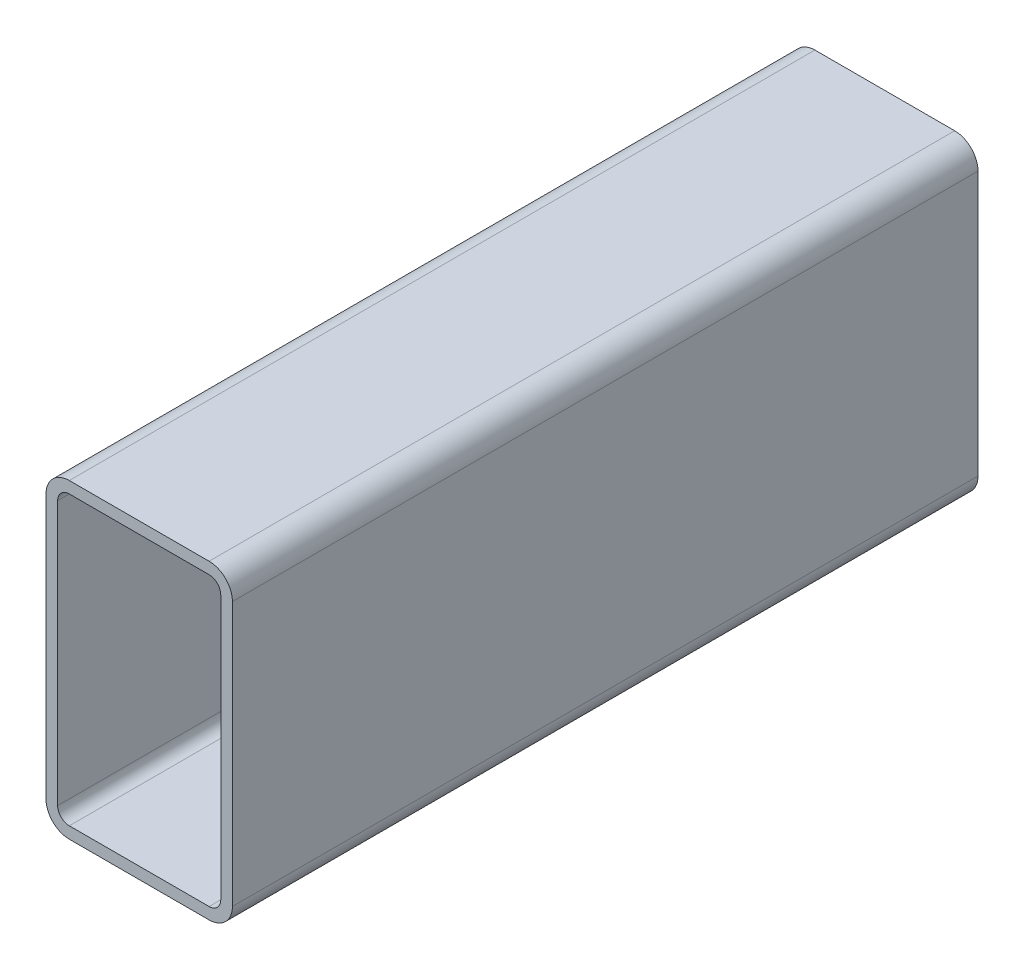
ISO-10303-21;
HEADER;
FILE_DESCRIPTION(('STEP AP214'),'2;1');
FILE_NAME('part.step','',(''),(''),'','','');
FILE_SCHEMA(('AUTOMOTIVE_DESIGN { 1 0 10303 214 1 1 1 1 }'));
ENDSEC;
DATA;
#1=APPLICATION_CONTEXT('core data for automotive mechanical design processes');
#2=APPLICATION_PROTOCOL_DEFINITION('international standard','automotive_design',2000,#1);
#3=PRODUCT_CONTEXT('',#1,'mechanical');
#4=PRODUCT('Part','Part','',(#3));
#5=PRODUCT_RELATED_PRODUCT_CATEGORY('part','',(#4));
#6=PRODUCT_DEFINITION_FORMATION('','',#4);
#7=PRODUCT_DEFINITION_CONTEXT('part definition',#1,'design');
#8=PRODUCT_DEFINITION('design','',#6,#7);
#9=PRODUCT_DEFINITION_SHAPE('','',#8);
#10=(LENGTH_UNIT() NAMED_UNIT(*) SI_UNIT(.MILLI.,.METRE.));
#11=(NAMED_UNIT(*) PLANE_ANGLE_UNIT() SI_UNIT($,.RADIAN.));
#12=(NAMED_UNIT(*) SI_UNIT($,.STERADIAN.) SOLID_ANGLE_UNIT());
#13=UNCERTAINTY_MEASURE_WITH_UNIT(LENGTH_MEASURE(1.E-05),#10,'distance_accuracy_value','');
#14=(GEOMETRIC_REPRESENTATION_CONTEXT(3) GLOBAL_UNCERTAINTY_ASSIGNED_CONTEXT((#13)) GLOBAL_UNIT_ASSIGNED_CONTEXT((#10,
#11,#12)) REPRESENTATION_CONTEXT('',''));
#15=CARTESIAN_POINT('',(0.,0.,0.));
#16=DIRECTION('',(0.,0.,1.));
#17=DIRECTION('',(1.,0.,0.));
#18=AXIS2_PLACEMENT_3D('',#15,#16,#17);
#19=CARTESIAN_POINT('',(12.0141160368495,119.509856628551,304.8));
#20=DIRECTION('',(0.,0.,1.));
#21=DIRECTION('',(1.,0.,0.));
#22=AXIS2_PLACEMENT_3D('',#19,#20,#21);
#23=PLANE('',#22);
#24=CARTESIAN_POINT('',(12.0141160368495,119.509856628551,304.8));
#25=DIRECTION('',(0.,0.,1.));
#26=DIRECTION('',(1.,0.,0.));
#27=AXIS2_PLACEMENT_3D('',#24,#25,#26);
#28=CIRCLE('',#27,9.52500000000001);
#29=CARTESIAN_POINT('',(12.0141160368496,129.034856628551,304.8));
#30=VERTEX_POINT('',#29);
#31=CARTESIAN_POINT('',(2.48911603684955,119.509856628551,304.8));
#32=VERTEX_POINT('',#31);
#33=EDGE_CURVE('E211',#30,#32,#28,.T.);
#34=ORIENTED_EDGE('',*,*,#33,.T.);
#35=DIRECTION('',(0.,-1.,0.));
#36=VECTOR('',#35,1.);
#37=CARTESIAN_POINT('',(2.48911603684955,11.5598566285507,304.8));
#38=LINE('',#37,#36);
#39=CARTESIAN_POINT('',(2.48911603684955,11.5598566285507,304.8));
#40=VERTEX_POINT('',#39);
#41=EDGE_CURVE('E214',#32,#40,#38,.T.);
#42=ORIENTED_EDGE('',*,*,#41,.T.);
#43=CARTESIAN_POINT('',(12.0141160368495,11.5598566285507,304.8));
#44=DIRECTION('',(0.,0.,1.));
#45=DIRECTION('',(1.,0.,0.));
#46=AXIS2_PLACEMENT_3D('',#43,#44,#45);
#47=CIRCLE('',#46,9.525);
#48=CARTESIAN_POINT('',(12.0141160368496,2.03485662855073,304.8));
#49=VERTEX_POINT('',#48);
#50=EDGE_CURVE('E217',#40,#49,#47,.T.);
#51=ORIENTED_EDGE('',*,*,#50,.T.);
#52=DIRECTION('',(1.,0.,0.));
#53=VECTOR('',#52,1.);
#54=CARTESIAN_POINT('',(69.1641160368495,2.03485662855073,304.8));
#55=LINE('',#54,#53);
#56=CARTESIAN_POINT('',(69.1641160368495,2.03485662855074,304.8));
#57=VERTEX_POINT('',#56);
#58=EDGE_CURVE('E219',#49,#57,#55,.T.);
#59=ORIENTED_EDGE('',*,*,#58,.T.);
#60=CARTESIAN_POINT('',(69.1641160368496,11.5598566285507,304.8));
#61=DIRECTION('',(0.,0.,1.));
#62=DIRECTION('',(1.,0.,0.));
#63=AXIS2_PLACEMENT_3D('',#60,#61,#62);
#64=CIRCLE('',#63,9.52499999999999);
#65=CARTESIAN_POINT('',(78.6891160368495,11.5598566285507,304.8));
#66=VERTEX_POINT('',#65);
#67=EDGE_CURVE('E221',#57,#66,#64,.T.);
#68=ORIENTED_EDGE('',*,*,#67,.T.);
#69=DIRECTION('',(0.,1.,0.));
#70=VECTOR('',#69,1.);
#71=CARTESIAN_POINT('',(78.6891160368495,119.509856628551,304.8));
#72=LINE('',#71,#70);
#73=CARTESIAN_POINT('',(78.6891160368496,119.509856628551,304.8));
#74=VERTEX_POINT('',#73);
#75=EDGE_CURVE('E223',#66,#74,#72,.T.);
#76=ORIENTED_EDGE('',*,*,#75,.T.);
#77=CARTESIAN_POINT('',(69.1641160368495,119.509856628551,304.8));
#78=DIRECTION('',(0.,0.,1.));
#79=DIRECTION('',(1.,0.,0.));
#80=AXIS2_PLACEMENT_3D('',#77,#78,#79);
#81=CIRCLE('',#80,9.52500000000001);
#82=CARTESIAN_POINT('',(69.1641160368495,129.034856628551,304.8));
#83=VERTEX_POINT('',#82);
#84=EDGE_CURVE('E225',#74,#83,#81,.T.);
#85=ORIENTED_EDGE('',*,*,#84,.T.);
#86=DIRECTION('',(-1.,0.,0.));
#87=VECTOR('',#86,1.);
#88=CARTESIAN_POINT('',(12.0141160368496,129.034856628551,304.8));
#89=LINE('',#88,#87);
#90=EDGE_CURVE('E227',#83,#30,#89,.T.);
#91=ORIENTED_EDGE('',*,*,#90,.T.);
#92=EDGE_LOOP('',(#34,#42,#51,#59,#68,#76,#85,#91));
#93=FACE_BOUND('',#92,.T.);
#94=DIRECTION('',(0.,-1.,0.));
#95=VECTOR('',#94,1.);
#96=CARTESIAN_POINT('',(7.25161603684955,11.5598566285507,304.8));
#97=LINE('',#96,#95);
#98=CARTESIAN_POINT('',(7.25161603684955,119.509856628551,304.8));
#99=VERTEX_POINT('',#98);
#100=CARTESIAN_POINT('',(7.25161603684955,11.5598566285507,304.8));
#101=VERTEX_POINT('',#100);
#102=EDGE_CURVE('E154',#99,#101,#97,.T.);
#103=ORIENTED_EDGE('',*,*,#102,.F.);
#104=CARTESIAN_POINT('',(12.0141160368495,119.509856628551,304.8));
#105=DIRECTION('',(0.,0.,1.));
#106=DIRECTION('',(1.,0.,0.));
#107=AXIS2_PLACEMENT_3D('',#104,#105,#106);
#108=CIRCLE('',#107,4.7625);
#109=CARTESIAN_POINT('',(12.0141160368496,124.272356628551,304.8));
#110=VERTEX_POINT('',#109);
#111=EDGE_CURVE('E146',#110,#99,#108,.T.);
#112=ORIENTED_EDGE('',*,*,#111,.F.);
#113=DIRECTION('',(-1.,0.,0.));
#114=VECTOR('',#113,1.);
#115=CARTESIAN_POINT('',(12.0141160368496,124.272356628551,304.8));
#116=LINE('',#115,#114);
#117=CARTESIAN_POINT('',(69.1641160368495,124.272356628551,304.8));
#118=VERTEX_POINT('',#117);
#119=EDGE_CURVE('E179',#118,#110,#116,.T.);
#120=ORIENTED_EDGE('',*,*,#119,.F.);
#121=CARTESIAN_POINT('',(69.1641160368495,119.509856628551,304.8));
#122=DIRECTION('',(0.,0.,1.));
#123=DIRECTION('',(1.,0.,0.));
#124=AXIS2_PLACEMENT_3D('',#121,#122,#123);
#125=CIRCLE('',#124,4.7625);
#126=CARTESIAN_POINT('',(73.9266160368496,119.509856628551,304.8));
#127=VERTEX_POINT('',#126);
#128=EDGE_CURVE('E177',#127,#118,#125,.T.);
#129=ORIENTED_EDGE('',*,*,#128,.F.);
#130=DIRECTION('',(0.,1.,0.));
#131=VECTOR('',#130,1.);
#132=CARTESIAN_POINT('',(73.9266160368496,119.509856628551,304.8));
#133=LINE('',#132,#131);
#134=CARTESIAN_POINT('',(73.9266160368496,11.5598566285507,304.8));
#135=VERTEX_POINT('',#134);
#136=EDGE_CURVE('E175',#135,#127,#133,.T.);
#137=ORIENTED_EDGE('',*,*,#136,.F.);
#138=CARTESIAN_POINT('',(69.1641160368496,11.5598566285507,304.8));
#139=DIRECTION('',(0.,0.,1.));
#140=DIRECTION('',(1.,0.,0.));
#141=AXIS2_PLACEMENT_3D('',#138,#139,#140);
#142=CIRCLE('',#141,4.76249999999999);
#143=CARTESIAN_POINT('',(69.1641160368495,6.79735662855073,304.8));
#144=VERTEX_POINT('',#143);
#145=EDGE_CURVE('E173',#144,#135,#142,.T.);
#146=ORIENTED_EDGE('',*,*,#145,.F.);
#147=DIRECTION('',(1.,0.,0.));
#148=VECTOR('',#147,1.);
#149=CARTESIAN_POINT('',(69.1641160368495,6.79735662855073,304.8));
#150=LINE('',#149,#148);
#151=CARTESIAN_POINT('',(12.0141160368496,6.79735662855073,304.8));
#152=VERTEX_POINT('',#151);
#153=EDGE_CURVE('E169',#152,#144,#150,.T.);
#154=ORIENTED_EDGE('',*,*,#153,.F.);
#155=CARTESIAN_POINT('',(12.0141160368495,11.5598566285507,304.8));
#156=DIRECTION('',(0.,0.,1.));
#157=DIRECTION('',(1.,0.,0.));
#158=AXIS2_PLACEMENT_3D('',#155,#156,#157);
#159=CIRCLE('',#158,4.76249999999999);
#160=EDGE_CURVE('E167',#101,#152,#159,.T.);
#161=ORIENTED_EDGE('',*,*,#160,.F.);
#162=EDGE_LOOP('',(#103,#112,#120,#129,#137,#146,#154,#161));
#163=FACE_BOUND('',#162,.T.);
#164=ADVANCED_FACE('F33',(#93,#163),#23,.T.);
#165=CARTESIAN_POINT('',(12.0141160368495,119.509856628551,0.));
#166=DIRECTION('',(0.,0.,1.));
#167=DIRECTION('',(1.,0.,0.));
#168=AXIS2_PLACEMENT_3D('',#165,#166,#167);
#169=PLANE('',#168);
#170=CARTESIAN_POINT('',(12.0141160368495,119.509856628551,0.));
#171=DIRECTION('',(0.,0.,1.));
#172=DIRECTION('',(1.,0.,0.));
#173=AXIS2_PLACEMENT_3D('',#170,#171,#172);
#174=CIRCLE('',#173,9.52500000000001);
#175=CARTESIAN_POINT('',(12.0141160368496,129.034856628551,0.));
#176=VERTEX_POINT('',#175);
#177=CARTESIAN_POINT('',(2.48911603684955,119.509856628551,0.));
#178=VERTEX_POINT('',#177);
#179=EDGE_CURVE('E162',#176,#178,#174,.T.);
#180=ORIENTED_EDGE('',*,*,#179,.F.);
#181=DIRECTION('',(-1.,0.,0.));
#182=VECTOR('',#181,1.);
#183=CARTESIAN_POINT('',(12.0141160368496,129.034856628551,0.));
#184=LINE('',#183,#182);
#185=CARTESIAN_POINT('',(69.1641160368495,129.034856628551,0.));
#186=VERTEX_POINT('',#185);
#187=EDGE_CURVE('E215',#186,#176,#184,.T.);
#188=ORIENTED_EDGE('',*,*,#187,.F.);
#189=CARTESIAN_POINT('',(69.1641160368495,119.509856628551,0.));
#190=DIRECTION('',(0.,0.,1.));
#191=DIRECTION('',(1.,0.,0.));
#192=AXIS2_PLACEMENT_3D('',#189,#190,#191);
#193=CIRCLE('',#192,9.52500000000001);
#194=CARTESIAN_POINT('',(78.6891160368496,119.509856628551,0.));
#195=VERTEX_POINT('',#194);
#196=EDGE_CURVE('E242',#195,#186,#193,.T.);
#197=ORIENTED_EDGE('',*,*,#196,.F.);
#198=DIRECTION('',(0.,1.,0.));
#199=VECTOR('',#198,1.);
#200=CARTESIAN_POINT('',(78.6891160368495,119.509856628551,0.));
#201=LINE('',#200,#199);
#202=CARTESIAN_POINT('',(78.6891160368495,11.5598566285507,0.));
#203=VERTEX_POINT('',#202);
#204=EDGE_CURVE('E240',#203,#195,#201,.T.);
#205=ORIENTED_EDGE('',*,*,#204,.F.);
#206=CARTESIAN_POINT('',(69.1641160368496,11.5598566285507,0.));
#207=DIRECTION('',(0.,0.,1.));
#208=DIRECTION('',(1.,0.,0.));
#209=AXIS2_PLACEMENT_3D('',#206,#207,#208);
#210=CIRCLE('',#209,9.52499999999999);
#211=CARTESIAN_POINT('',(69.1641160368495,2.03485662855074,0.));
#212=VERTEX_POINT('',#211);
#213=EDGE_CURVE('E238',#212,#203,#210,.T.);
#214=ORIENTED_EDGE('',*,*,#213,.F.);
#215=DIRECTION('',(1.,0.,0.));
#216=VECTOR('',#215,1.);
#217=CARTESIAN_POINT('',(69.1641160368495,2.03485662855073,0.));
#218=LINE('',#217,#216);
#219=CARTESIAN_POINT('',(12.0141160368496,2.03485662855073,0.));
#220=VERTEX_POINT('',#219);
#221=EDGE_CURVE('E236',#220,#212,#218,.T.);
#222=ORIENTED_EDGE('',*,*,#221,.F.);
#223=CARTESIAN_POINT('',(12.0141160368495,11.5598566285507,0.));
#224=DIRECTION('',(0.,0.,1.));
#225=DIRECTION('',(1.,0.,0.));
#226=AXIS2_PLACEMENT_3D('',#223,#224,#225);
#227=CIRCLE('',#226,9.525);
#228=CARTESIAN_POINT('',(2.48911603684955,11.5598566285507,0.));
#229=VERTEX_POINT('',#228);
#230=EDGE_CURVE('E234',#229,#220,#227,.T.);
#231=ORIENTED_EDGE('',*,*,#230,.F.);
#232=DIRECTION('',(0.,-1.,0.));
#233=VECTOR('',#232,1.);
#234=CARTESIAN_POINT('',(2.48911603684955,11.5598566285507,0.));
#235=LINE('',#234,#233);
#236=EDGE_CURVE('E232',#178,#229,#235,.T.);
#237=ORIENTED_EDGE('',*,*,#236,.F.);
#238=EDGE_LOOP('',(#180,#188,#197,#205,#214,#222,#231,#237));
#239=FACE_BOUND('',#238,.T.);
#240=CARTESIAN_POINT('',(12.0141160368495,119.509856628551,0.));
#241=DIRECTION('',(0.,0.,1.));
#242=DIRECTION('',(1.,0.,0.));
#243=AXIS2_PLACEMENT_3D('',#240,#241,#242);
#244=CIRCLE('',#243,4.7625);
#245=CARTESIAN_POINT('',(12.0141160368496,124.272356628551,0.));
#246=VERTEX_POINT('',#245);
#247=CARTESIAN_POINT('',(7.25161603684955,119.509856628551,0.));
#248=VERTEX_POINT('',#247);
#249=EDGE_CURVE('E56',#246,#248,#244,.T.);
#250=ORIENTED_EDGE('',*,*,#249,.T.);
#251=DIRECTION('',(0.,-1.,0.));
#252=VECTOR('',#251,1.);
#253=CARTESIAN_POINT('',(7.25161603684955,11.5598566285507,0.));
#254=LINE('',#253,#252);
#255=CARTESIAN_POINT('',(7.25161603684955,11.5598566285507,0.));
#256=VERTEX_POINT('',#255);
#257=EDGE_CURVE('E161',#248,#256,#254,.T.);
#258=ORIENTED_EDGE('',*,*,#257,.T.);
#259=CARTESIAN_POINT('',(12.0141160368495,11.5598566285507,0.));
#260=DIRECTION('',(0.,0.,1.));
#261=DIRECTION('',(1.,0.,0.));
#262=AXIS2_PLACEMENT_3D('',#259,#260,#261);
#263=CIRCLE('',#262,4.76249999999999);
#264=CARTESIAN_POINT('',(12.0141160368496,6.79735662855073,0.));
#265=VERTEX_POINT('',#264);
#266=EDGE_CURVE('E183',#256,#265,#263,.T.);
#267=ORIENTED_EDGE('',*,*,#266,.T.);
#268=DIRECTION('',(1.,0.,0.));
#269=VECTOR('',#268,1.);
#270=CARTESIAN_POINT('',(69.1641160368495,6.79735662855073,0.));
#271=LINE('',#270,#269);
#272=CARTESIAN_POINT('',(69.1641160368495,6.79735662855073,0.));
#273=VERTEX_POINT('',#272);
#274=EDGE_CURVE('E186',#265,#273,#271,.T.);
#275=ORIENTED_EDGE('',*,*,#274,.T.);
#276=CARTESIAN_POINT('',(69.1641160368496,11.5598566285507,0.));
#277=DIRECTION('',(0.,0.,1.));
#278=DIRECTION('',(1.,0.,0.));
#279=AXIS2_PLACEMENT_3D('',#276,#277,#278);
#280=CIRCLE('',#279,4.76249999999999);
#281=CARTESIAN_POINT('',(73.9266160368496,11.5598566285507,0.));
#282=VERTEX_POINT('',#281);
#283=EDGE_CURVE('E189',#273,#282,#280,.T.);
#284=ORIENTED_EDGE('',*,*,#283,.T.);
#285=DIRECTION('',(0.,1.,0.));
#286=VECTOR('',#285,1.);
#287=CARTESIAN_POINT('',(73.9266160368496,119.509856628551,0.));
#288=LINE('',#287,#286);
#289=CARTESIAN_POINT('',(73.9266160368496,119.509856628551,0.));
#290=VERTEX_POINT('',#289);
#291=EDGE_CURVE('E192',#282,#290,#288,.T.);
#292=ORIENTED_EDGE('',*,*,#291,.T.);
#293=CARTESIAN_POINT('',(69.1641160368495,119.509856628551,0.));
#294=DIRECTION('',(0.,0.,1.));
#295=DIRECTION('',(1.,0.,0.));
#296=AXIS2_PLACEMENT_3D('',#293,#294,#295);
#297=CIRCLE('',#296,4.7625);
#298=CARTESIAN_POINT('',(69.1641160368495,124.272356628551,0.));
#299=VERTEX_POINT('',#298);
#300=EDGE_CURVE('E195',#290,#299,#297,.T.);
#301=ORIENTED_EDGE('',*,*,#300,.T.);
#302=DIRECTION('',(-1.,0.,0.));
#303=VECTOR('',#302,1.);
#304=CARTESIAN_POINT('',(12.0141160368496,124.272356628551,0.));
#305=LINE('',#304,#303);
#306=EDGE_CURVE('E155',#299,#246,#305,.T.);
#307=ORIENTED_EDGE('',*,*,#306,.T.);
#308=EDGE_LOOP('',(#250,#258,#267,#275,#284,#292,#301,#307));
#309=FACE_BOUND('',#308,.T.);
#310=ADVANCED_FACE('F272',(#239,#309),#169,.F.);
#311=CARTESIAN_POINT('',(12.0141160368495,119.509856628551,304.8));
#312=DIRECTION('',(0.,0.,-1.));
#313=DIRECTION('',(-1.,0.,0.));
#314=AXIS2_PLACEMENT_3D('',#311,#312,#313);
#315=CYLINDRICAL_SURFACE('',#314,9.52500000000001);
#316=ORIENTED_EDGE('',*,*,#179,.T.);
#317=DIRECTION('',(0.,0.,-1.));
#318=VECTOR('',#317,1.);
#319=CARTESIAN_POINT('',(2.48911603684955,119.509856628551,304.8));
#320=LINE('',#319,#318);
#321=EDGE_CURVE('E11',#32,#178,#320,.T.);
#322=ORIENTED_EDGE('',*,*,#321,.F.);
#323=ORIENTED_EDGE('',*,*,#33,.F.);
#324=DIRECTION('',(0.,0.,-1.));
#325=VECTOR('',#324,1.);
#326=CARTESIAN_POINT('',(12.0141160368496,129.034856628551,304.8));
#327=LINE('',#326,#325);
#328=EDGE_CURVE('E229',#30,#176,#327,.T.);
#329=ORIENTED_EDGE('',*,*,#328,.T.);
#330=EDGE_LOOP('',(#316,#322,#323,#329));
#331=FACE_BOUND('',#330,.T.);
#332=ADVANCED_FACE('F35',(#331),#315,.T.);
#333=CARTESIAN_POINT('',(2.48911603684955,11.5598566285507,304.8));
#334=DIRECTION('',(1.,0.,0.));
#335=DIRECTION('',(0.,0.,-1.));
#336=AXIS2_PLACEMENT_3D('',#333,#334,#335);
#337=PLANE('',#336);
#338=ORIENTED_EDGE('',*,*,#236,.T.);
#339=DIRECTION('',(0.,0.,-1.));
#340=VECTOR('',#339,1.);
#341=CARTESIAN_POINT('',(2.48911603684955,11.5598566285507,304.8));
#342=LINE('',#341,#340);
#343=EDGE_CURVE('E41',#40,#229,#342,.T.);
#344=ORIENTED_EDGE('',*,*,#343,.F.);
#345=ORIENTED_EDGE('',*,*,#41,.F.);
#346=ORIENTED_EDGE('',*,*,#321,.T.);
#347=EDGE_LOOP('',(#338,#344,#345,#346));
#348=FACE_BOUND('',#347,.T.);
#349=ADVANCED_FACE('F289',(#348),#337,.F.);
#350=CARTESIAN_POINT('',(12.0141160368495,11.5598566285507,304.8));
#351=DIRECTION('',(0.,0.,-1.));
#352=DIRECTION('',(-1.,0.,0.));
#353=AXIS2_PLACEMENT_3D('',#350,#351,#352);
#354=CYLINDRICAL_SURFACE('',#353,9.525);
#355=ORIENTED_EDGE('',*,*,#230,.T.);
#356=DIRECTION('',(0.,0.,-1.));
#357=VECTOR('',#356,1.);
#358=CARTESIAN_POINT('',(12.0141160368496,2.03485662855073,304.8));
#359=LINE('',#358,#357);
#360=EDGE_CURVE('E259',#49,#220,#359,.T.);
#361=ORIENTED_EDGE('',*,*,#360,.F.);
#362=ORIENTED_EDGE('',*,*,#50,.F.);
#363=ORIENTED_EDGE('',*,*,#343,.T.);
#364=EDGE_LOOP('',(#355,#361,#362,#363));
#365=FACE_BOUND('',#364,.T.);
#366=ADVANCED_FACE('F266',(#365),#354,.T.);
#367=CARTESIAN_POINT('',(69.1641160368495,2.03485662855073,304.8));
#368=DIRECTION('',(0.,1.,0.));
#369=DIRECTION('',(0.,0.,1.));
#370=AXIS2_PLACEMENT_3D('',#367,#368,#369);
#371=PLANE('',#370);
#372=ORIENTED_EDGE('',*,*,#221,.T.);
#373=DIRECTION('',(0.,0.,-1.));
#374=VECTOR('',#373,1.);
#375=CARTESIAN_POINT('',(69.1641160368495,2.03485662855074,304.8));
#376=LINE('',#375,#374);
#377=EDGE_CURVE('E256',#57,#212,#376,.T.);
#378=ORIENTED_EDGE('',*,*,#377,.F.);
#379=ORIENTED_EDGE('',*,*,#58,.F.);
#380=ORIENTED_EDGE('',*,*,#360,.T.);
#381=EDGE_LOOP('',(#372,#378,#379,#380));
#382=FACE_BOUND('',#381,.T.);
#383=ADVANCED_FACE('F278',(#382),#371,.F.);
#384=CARTESIAN_POINT('',(69.1641160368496,11.5598566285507,304.8));
#385=DIRECTION('',(0.,0.,-1.));
#386=DIRECTION('',(-1.,0.,0.));
#387=AXIS2_PLACEMENT_3D('',#384,#385,#386);
#388=CYLINDRICAL_SURFACE('',#387,9.52499999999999);
#389=ORIENTED_EDGE('',*,*,#213,.T.);
#390=DIRECTION('',(0.,0.,-1.));
#391=VECTOR('',#390,1.);
#392=CARTESIAN_POINT('',(78.6891160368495,11.5598566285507,304.8));
#393=LINE('',#392,#391);
#394=EDGE_CURVE('E253',#66,#203,#393,.T.);
#395=ORIENTED_EDGE('',*,*,#394,.F.);
#396=ORIENTED_EDGE('',*,*,#67,.F.);
#397=ORIENTED_EDGE('',*,*,#377,.T.);
#398=EDGE_LOOP('',(#389,#395,#396,#397));
#399=FACE_BOUND('',#398,.T.);
#400=ADVANCED_FACE('F282',(#399),#388,.T.);
#401=CARTESIAN_POINT('',(78.6891160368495,119.509856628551,304.8));
#402=DIRECTION('',(-1.,0.,0.));
#403=DIRECTION('',(0.,0.,1.));
#404=AXIS2_PLACEMENT_3D('',#401,#402,#403);
#405=PLANE('',#404);
#406=ORIENTED_EDGE('',*,*,#204,.T.);
#407=DIRECTION('',(0.,0.,-1.));
#408=VECTOR('',#407,1.);
#409=CARTESIAN_POINT('',(78.6891160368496,119.509856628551,304.8));
#410=LINE('',#409,#408);
#411=EDGE_CURVE('E250',#74,#195,#410,.T.);
#412=ORIENTED_EDGE('',*,*,#411,.F.);
#413=ORIENTED_EDGE('',*,*,#75,.F.);
#414=ORIENTED_EDGE('',*,*,#394,.T.);
#415=EDGE_LOOP('',(#406,#412,#413,#414));
#416=FACE_BOUND('',#415,.T.);
#417=ADVANCED_FACE('F302',(#416),#405,.F.);
#418=CARTESIAN_POINT('',(69.1641160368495,119.509856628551,304.8));
#419=DIRECTION('',(0.,0.,-1.));
#420=DIRECTION('',(-1.,0.,0.));
#421=AXIS2_PLACEMENT_3D('',#418,#419,#420);
#422=CYLINDRICAL_SURFACE('',#421,9.52500000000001);
#423=ORIENTED_EDGE('',*,*,#196,.T.);
#424=DIRECTION('',(0.,0.,-1.));
#425=VECTOR('',#424,1.);
#426=CARTESIAN_POINT('',(69.1641160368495,129.034856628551,304.8));
#427=LINE('',#426,#425);
#428=EDGE_CURVE('E247',#83,#186,#427,.T.);
#429=ORIENTED_EDGE('',*,*,#428,.F.);
#430=ORIENTED_EDGE('',*,*,#84,.F.);
#431=ORIENTED_EDGE('',*,*,#411,.T.);
#432=EDGE_LOOP('',(#423,#429,#430,#431));
#433=FACE_BOUND('',#432,.T.);
#434=ADVANCED_FACE('F300',(#433),#422,.T.);
#435=CARTESIAN_POINT('',(12.0141160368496,129.034856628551,304.8));
#436=DIRECTION('',(0.,-1.,0.));
#437=DIRECTION('',(0.,0.,-1.));
#438=AXIS2_PLACEMENT_3D('',#435,#436,#437);
#439=PLANE('',#438);
#440=ORIENTED_EDGE('',*,*,#187,.T.);
#441=ORIENTED_EDGE('',*,*,#328,.F.);
#442=ORIENTED_EDGE('',*,*,#90,.F.);
#443=ORIENTED_EDGE('',*,*,#428,.T.);
#444=EDGE_LOOP('',(#440,#441,#442,#443));
#445=FACE_BOUND('',#444,.T.);
#446=ADVANCED_FACE('F295',(#445),#439,.F.);
#447=CARTESIAN_POINT('',(12.0141160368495,119.509856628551,304.8));
#448=DIRECTION('',(0.,0.,-1.));
#449=DIRECTION('',(-1.,0.,0.));
#450=AXIS2_PLACEMENT_3D('',#447,#448,#449);
#451=CYLINDRICAL_SURFACE('',#450,4.7625);
#452=ORIENTED_EDGE('',*,*,#249,.F.);
#453=DIRECTION('',(0.,0.,-1.));
#454=VECTOR('',#453,1.);
#455=CARTESIAN_POINT('',(12.0141160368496,124.272356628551,304.8));
#456=LINE('',#455,#454);
#457=EDGE_CURVE('E150',#110,#246,#456,.T.);
#458=ORIENTED_EDGE('',*,*,#457,.F.);
#459=ORIENTED_EDGE('',*,*,#111,.T.);
#460=DIRECTION('',(0.,0.,-1.));
#461=VECTOR('',#460,1.);
#462=CARTESIAN_POINT('',(7.25161603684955,119.509856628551,304.8));
#463=LINE('',#462,#461);
#464=EDGE_CURVE('E149',#99,#248,#463,.T.);
#465=ORIENTED_EDGE('',*,*,#464,.T.);
#466=EDGE_LOOP('',(#452,#458,#459,#465));
#467=FACE_BOUND('',#466,.T.);
#468=ADVANCED_FACE('F148',(#467),#451,.F.);
#469=CARTESIAN_POINT('',(7.25161603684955,11.5598566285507,304.8));
#470=DIRECTION('',(1.,0.,0.));
#471=DIRECTION('',(0.,0.,-1.));
#472=AXIS2_PLACEMENT_3D('',#469,#470,#471);
#473=PLANE('',#472);
#474=ORIENTED_EDGE('',*,*,#257,.F.);
#475=ORIENTED_EDGE('',*,*,#464,.F.);
#476=ORIENTED_EDGE('',*,*,#102,.T.);
#477=DIRECTION('',(0.,0.,-1.));
#478=VECTOR('',#477,1.);
#479=CARTESIAN_POINT('',(7.25161603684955,11.5598566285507,304.8));
#480=LINE('',#479,#478);
#481=EDGE_CURVE('E163',#101,#256,#480,.T.);
#482=ORIENTED_EDGE('',*,*,#481,.T.);
#483=EDGE_LOOP('',(#474,#475,#476,#482));
#484=FACE_BOUND('',#483,.T.);
#485=ADVANCED_FACE('F158',(#484),#473,.T.);
#486=CARTESIAN_POINT('',(12.0141160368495,11.5598566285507,304.8));
#487=DIRECTION('',(0.,0.,-1.));
#488=DIRECTION('',(-1.,0.,0.));
#489=AXIS2_PLACEMENT_3D('',#486,#487,#488);
#490=CYLINDRICAL_SURFACE('',#489,4.76249999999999);
#491=ORIENTED_EDGE('',*,*,#266,.F.);
#492=ORIENTED_EDGE('',*,*,#481,.F.);
#493=ORIENTED_EDGE('',*,*,#160,.T.);
#494=DIRECTION('',(0.,0.,-1.));
#495=VECTOR('',#494,1.);
#496=CARTESIAN_POINT('',(12.0141160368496,6.79735662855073,304.8));
#497=LINE('',#496,#495);
#498=EDGE_CURVE('E208',#152,#265,#497,.T.);
#499=ORIENTED_EDGE('',*,*,#498,.T.);
#500=EDGE_LOOP('',(#491,#492,#493,#499));
#501=FACE_BOUND('',#500,.T.);
#502=ADVANCED_FACE('F327',(#501),#490,.F.);
#503=CARTESIAN_POINT('',(69.1641160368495,6.79735662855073,304.8));
#504=DIRECTION('',(0.,1.,0.));
#505=DIRECTION('',(0.,0.,1.));
#506=AXIS2_PLACEMENT_3D('',#503,#504,#505);
#507=PLANE('',#506);
#508=ORIENTED_EDGE('',*,*,#274,.F.);
#509=ORIENTED_EDGE('',*,*,#498,.F.);
#510=ORIENTED_EDGE('',*,*,#153,.T.);
#511=DIRECTION('',(0.,0.,-1.));
#512=VECTOR('',#511,1.);
#513=CARTESIAN_POINT('',(69.1641160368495,6.79735662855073,304.8));
#514=LINE('',#513,#512);
#515=EDGE_CURVE('E206',#144,#273,#514,.T.);
#516=ORIENTED_EDGE('',*,*,#515,.T.);
#517=EDGE_LOOP('',(#508,#509,#510,#516));
#518=FACE_BOUND('',#517,.T.);
#519=ADVANCED_FACE('F331',(#518),#507,.T.);
#520=CARTESIAN_POINT('',(69.1641160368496,11.5598566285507,304.8));
#521=DIRECTION('',(0.,0.,-1.));
#522=DIRECTION('',(-1.,0.,0.));
#523=AXIS2_PLACEMENT_3D('',#520,#521,#522);
#524=CYLINDRICAL_SURFACE('',#523,4.76249999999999);
#525=ORIENTED_EDGE('',*,*,#283,.F.);
#526=ORIENTED_EDGE('',*,*,#515,.F.);
#527=ORIENTED_EDGE('',*,*,#145,.T.);
#528=DIRECTION('',(0.,0.,-1.));
#529=VECTOR('',#528,1.);
#530=CARTESIAN_POINT('',(73.9266160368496,11.5598566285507,304.8));
#531=LINE('',#530,#529);
#532=EDGE_CURVE('E204',#135,#282,#531,.T.);
#533=ORIENTED_EDGE('',*,*,#532,.T.);
#534=EDGE_LOOP('',(#525,#526,#527,#533));
#535=FACE_BOUND('',#534,.T.);
#536=ADVANCED_FACE('F337',(#535),#524,.F.);
#537=CARTESIAN_POINT('',(73.9266160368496,119.509856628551,304.8));
#538=DIRECTION('',(-1.,0.,0.));
#539=DIRECTION('',(0.,0.,1.));
#540=AXIS2_PLACEMENT_3D('',#537,#538,#539);
#541=PLANE('',#540);
#542=ORIENTED_EDGE('',*,*,#291,.F.);
#543=ORIENTED_EDGE('',*,*,#532,.F.);
#544=ORIENTED_EDGE('',*,*,#136,.T.);
#545=DIRECTION('',(0.,0.,-1.));
#546=VECTOR('',#545,1.);
#547=CARTESIAN_POINT('',(73.9266160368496,119.509856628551,304.8));
#548=LINE('',#547,#546);
#549=EDGE_CURVE('E202',#127,#290,#548,.T.);
#550=ORIENTED_EDGE('',*,*,#549,.T.);
#551=EDGE_LOOP('',(#542,#543,#544,#550));
#552=FACE_BOUND('',#551,.T.);
#553=ADVANCED_FACE('F341',(#552),#541,.T.);
#554=CARTESIAN_POINT('',(69.1641160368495,119.509856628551,304.8));
#555=DIRECTION('',(0.,0.,-1.));
#556=DIRECTION('',(-1.,0.,0.));
#557=AXIS2_PLACEMENT_3D('',#554,#555,#556);
#558=CYLINDRICAL_SURFACE('',#557,4.7625);
#559=ORIENTED_EDGE('',*,*,#300,.F.);
#560=ORIENTED_EDGE('',*,*,#549,.F.);
#561=ORIENTED_EDGE('',*,*,#128,.T.);
#562=DIRECTION('',(0.,0.,-1.));
#563=VECTOR('',#562,1.);
#564=CARTESIAN_POINT('',(69.1641160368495,124.272356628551,304.8));
#565=LINE('',#564,#563);
#566=EDGE_CURVE('E48',#118,#299,#565,.T.);
#567=ORIENTED_EDGE('',*,*,#566,.T.);
#568=EDGE_LOOP('',(#559,#560,#561,#567));
#569=FACE_BOUND('',#568,.T.);
#570=ADVANCED_FACE('F345',(#569),#558,.F.);
#571=CARTESIAN_POINT('',(12.0141160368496,124.272356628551,304.8));
#572=DIRECTION('',(0.,-1.,0.));
#573=DIRECTION('',(0.,0.,-1.));
#574=AXIS2_PLACEMENT_3D('',#571,#572,#573);
#575=PLANE('',#574);
#576=ORIENTED_EDGE('',*,*,#306,.F.);
#577=ORIENTED_EDGE('',*,*,#566,.F.);
#578=ORIENTED_EDGE('',*,*,#119,.T.);
#579=ORIENTED_EDGE('',*,*,#457,.T.);
#580=EDGE_LOOP('',(#576,#577,#578,#579));
#581=FACE_BOUND('',#580,.T.);
#582=ADVANCED_FACE('F349',(#581),#575,.T.);
#583=CLOSED_SHELL('',(#164,#310,#332,#349,#366,#383,#400,#417,#434,#446,#468,#485,#502,#519,
#536,#553,#570,#582));
#584=MANIFOLD_SOLID_BREP('B2',#583);
#585=ADVANCED_BREP_SHAPE_REPRESENTATION('',(#18,#584),#14);
#586=SHAPE_DEFINITION_REPRESENTATION(#9,#585);
ENDSEC;
END-ISO-10303-21;
